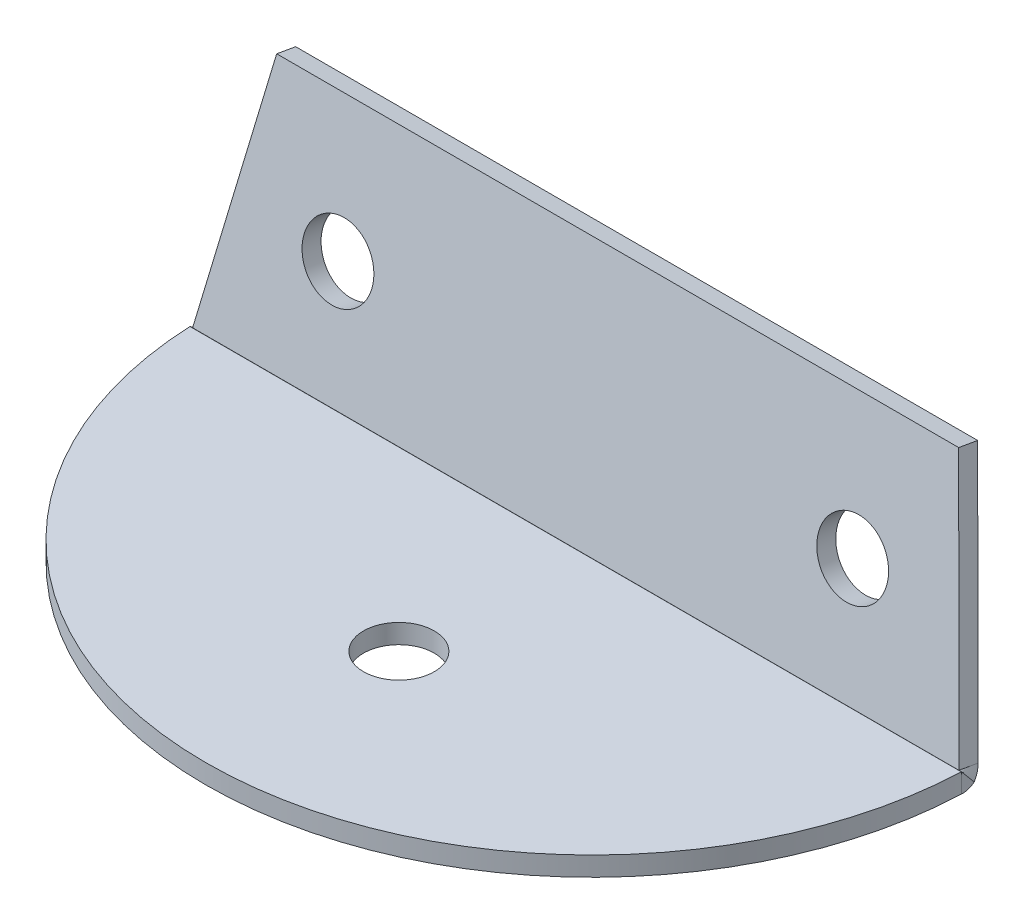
ISO-10303-21;
HEADER;
FILE_DESCRIPTION(('STEP AP214'),'2;1');
FILE_NAME('part.step','',(''),(''),'','','');
FILE_SCHEMA(('AUTOMOTIVE_DESIGN { 1 0 10303 214 1 1 1 1 }'));
ENDSEC;
DATA;
#1=APPLICATION_CONTEXT('core data for automotive mechanical design processes');
#2=APPLICATION_PROTOCOL_DEFINITION('international standard','automotive_design',2000,#1);
#3=PRODUCT_CONTEXT('',#1,'mechanical');
#4=PRODUCT('Part','Part','',(#3));
#5=PRODUCT_RELATED_PRODUCT_CATEGORY('part','',(#4));
#6=PRODUCT_DEFINITION_FORMATION('','',#4);
#7=PRODUCT_DEFINITION_CONTEXT('part definition',#1,'design');
#8=PRODUCT_DEFINITION('design','',#6,#7);
#9=PRODUCT_DEFINITION_SHAPE('','',#8);
#10=(LENGTH_UNIT() NAMED_UNIT(*) SI_UNIT(.MILLI.,.METRE.));
#11=(NAMED_UNIT(*) PLANE_ANGLE_UNIT() SI_UNIT($,.RADIAN.));
#12=(NAMED_UNIT(*) SI_UNIT($,.STERADIAN.) SOLID_ANGLE_UNIT());
#13=UNCERTAINTY_MEASURE_WITH_UNIT(LENGTH_MEASURE(1.E-05),#10,'distance_accuracy_value','');
#14=(GEOMETRIC_REPRESENTATION_CONTEXT(3) GLOBAL_UNCERTAINTY_ASSIGNED_CONTEXT((#13)) GLOBAL_UNIT_ASSIGNED_CONTEXT((#10,
#11,#12)) REPRESENTATION_CONTEXT('',''));
#15=CARTESIAN_POINT('',(0.,0.,0.));
#16=DIRECTION('',(0.,0.,1.));
#17=DIRECTION('',(1.,0.,0.));
#18=AXIS2_PLACEMENT_3D('',#15,#16,#17);
#19=CARTESIAN_POINT('',(3.5,19.9615513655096,-2.00162016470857));
#20=DIRECTION('',(0.985030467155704,-0.169761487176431,0.0299335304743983));
#21=DIRECTION('',(0.172380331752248,0.970065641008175,-0.17104874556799));
#22=AXIS2_PLACEMENT_3D('',#19,#20,#21);
#23=PLANE('',#22);
#24=DIRECTION('',(-0.172380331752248,-0.970065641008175,0.17104874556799));
#25=VECTOR('',#24,1.);
#26=CARTESIAN_POINT('',(3.5,19.7010790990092,-3.47883179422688));
#27=LINE('',#26,#25);
#28=CARTESIAN_POINT('',(3.5,19.7010790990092,-3.47883179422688));
#29=VERTEX_POINT('',#28);
#30=CARTESIAN_POINT('',(0.220857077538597,1.24779125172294,-0.225019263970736));
#31=VERTEX_POINT('',#30);
#32=EDGE_CURVE('E88',#29,#31,#27,.T.);
#33=ORIENTED_EDGE('',*,*,#32,.T.);
#34=CARTESIAN_POINT('',(0.220857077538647,1.50826351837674,1.25219236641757));
#35=CARTESIAN_POINT('',(0.220857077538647,1.24779125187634,-0.225019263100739));
#36=B_SPLINE_CURVE_WITH_KNOTS('',1,(#34,#35),.UNSPECIFIED.,.F.,.F.,(2,2),(0.,1.),.UNSPECIFIED.);
#37=CARTESIAN_POINT('',(0.220857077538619,1.50826351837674,1.25219236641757));
#38=VERTEX_POINT('',#37);
#39=EDGE_CURVE('E365',#31,#38,#36,.F.);
#40=ORIENTED_EDGE('',*,*,#39,.T.);
#41=DIRECTION('',(-0.172380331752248,-0.970065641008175,0.17104874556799));
#42=VECTOR('',#41,1.);
#43=CARTESIAN_POINT('',(3.5,19.9615513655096,-2.00162016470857));
#44=LINE('',#43,#42);
#45=CARTESIAN_POINT('',(3.5,19.9615513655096,-2.00162016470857));
#46=VERTEX_POINT('',#45);
#47=EDGE_CURVE('E431',#46,#38,#44,.T.);
#48=ORIENTED_EDGE('',*,*,#47,.F.);
#49=DIRECTION('',(0.,-0.173648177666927,-0.984807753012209));
#50=VECTOR('',#49,1.);
#51=CARTESIAN_POINT('',(3.5,19.9615513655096,-2.00162016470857));
#52=LINE('',#51,#50);
#53=EDGE_CURVE('E397',#46,#29,#52,.T.);
#54=ORIENTED_EDGE('',*,*,#53,.T.);
#55=EDGE_LOOP('',(#33,#40,#48,#54));
#56=FACE_BOUND('',#55,.T.);
#57=ADVANCED_FACE('F62',(#56),#23,.F.);
#58=CARTESIAN_POINT('',(56.5,19.9615513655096,-2.00162016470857));
#59=DIRECTION('',(-0.985030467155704,-0.169761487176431,0.0299335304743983));
#60=DIRECTION('',(0.172380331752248,-0.970065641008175,0.17104874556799));
#61=AXIS2_PLACEMENT_3D('',#58,#59,#60);
#62=PLANE('',#61);
#63=DIRECTION('',(-0.172380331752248,0.970065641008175,-0.17104874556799));
#64=VECTOR('',#63,1.);
#65=CARTESIAN_POINT('',(56.5,19.9615513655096,-2.00162016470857));
#66=LINE('',#65,#64);
#67=CARTESIAN_POINT('',(59.7791429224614,1.50826351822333,1.25219236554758));
#68=VERTEX_POINT('',#67);
#69=CARTESIAN_POINT('',(56.5,19.9615513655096,-2.00162016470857));
#70=VERTEX_POINT('',#69);
#71=EDGE_CURVE('E405',#68,#70,#66,.T.);
#72=ORIENTED_EDGE('',*,*,#71,.F.);
#73=CARTESIAN_POINT('',(59.7791429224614,1.24779125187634,-0.225019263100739));
#74=CARTESIAN_POINT('',(59.7791429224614,1.50826351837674,1.25219236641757));
#75=B_SPLINE_CURVE_WITH_KNOTS('',1,(#73,#74),.UNSPECIFIED.,.F.,.F.,(2,2),(0.,1.),.UNSPECIFIED.);
#76=CARTESIAN_POINT('',(59.7791429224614,1.24779125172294,-0.225019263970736));
#77=VERTEX_POINT('',#76);
#78=EDGE_CURVE('E12',#68,#77,#75,.F.);
#79=ORIENTED_EDGE('',*,*,#78,.T.);
#80=DIRECTION('',(-0.172380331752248,0.970065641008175,-0.17104874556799));
#81=VECTOR('',#80,1.);
#82=CARTESIAN_POINT('',(56.5,19.7010790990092,-3.47883179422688));
#83=LINE('',#82,#81);
#84=CARTESIAN_POINT('',(56.5,19.7010790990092,-3.47883179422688));
#85=VERTEX_POINT('',#84);
#86=EDGE_CURVE('E81',#77,#85,#83,.T.);
#87=ORIENTED_EDGE('',*,*,#86,.T.);
#88=DIRECTION('',(0.,-0.173648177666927,-0.984807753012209));
#89=VECTOR('',#88,1.);
#90=CARTESIAN_POINT('',(56.5,19.9615513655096,-2.00162016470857));
#91=LINE('',#90,#89);
#92=EDGE_CURVE('E394',#70,#85,#91,.T.);
#93=ORIENTED_EDGE('',*,*,#92,.F.);
#94=EDGE_LOOP('',(#72,#79,#87,#93));
#95=FACE_BOUND('',#94,.T.);
#96=ADVANCED_FACE('F64',(#95),#62,.F.);
#97=CARTESIAN_POINT('',(30.,0.00492403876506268,-0.00586824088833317));
#98=DIRECTION('',(0.,0.173648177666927,0.984807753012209));
#99=DIRECTION('',(0.,-0.984807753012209,0.173648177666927));
#100=AXIS2_PLACEMENT_3D('',#97,#98,#99);
#101=PLANE('',#100);
#102=CARTESIAN_POINT('',(10.,9.85300156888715,-1.74235001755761));
#103=DIRECTION('',(0.,0.173648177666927,0.984807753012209));
#104=DIRECTION('',(0.,-0.984807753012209,0.173648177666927));
#105=AXIS2_PLACEMENT_3D('',#102,#103,#104);
#106=CIRCLE('',#105,2.75);
#107=CARTESIAN_POINT('',(10.,7.14478024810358,-1.26481752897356));
#108=VERTEX_POINT('',#107);
#109=EDGE_CURVE('E442',#108,#108,#106,.T.);
#110=ORIENTED_EDGE('',*,*,#109,.T.);
#111=EDGE_LOOP('',(#110));
#112=FACE_BOUND('',#111,.T.);
#113=CARTESIAN_POINT('',(50.,9.85300156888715,-1.74235001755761));
#114=DIRECTION('',(0.,0.173648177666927,0.984807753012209));
#115=DIRECTION('',(0.,-0.984807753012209,0.173648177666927));
#116=AXIS2_PLACEMENT_3D('',#113,#114,#115);
#117=CIRCLE('',#116,2.75);
#118=CARTESIAN_POINT('',(50.,7.14478024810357,-1.26481752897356));
#119=VERTEX_POINT('',#118);
#120=EDGE_CURVE('E448',#119,#119,#117,.T.);
#121=ORIENTED_EDGE('',*,*,#120,.T.);
#122=EDGE_LOOP('',(#121));
#123=FACE_BOUND('',#122,.T.);
#124=ORIENTED_EDGE('',*,*,#86,.F.);
#125=DIRECTION('',(-1.,0.,0.));
#126=VECTOR('',#125,1.);
#127=CARTESIAN_POINT('',(30.,1.24779125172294,-0.225019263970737));
#128=LINE('',#127,#126);
#129=EDGE_CURVE('E74',#77,#31,#128,.T.);
#130=ORIENTED_EDGE('',*,*,#129,.T.);
#131=ORIENTED_EDGE('',*,*,#32,.F.);
#132=DIRECTION('',(-1.,0.,0.));
#133=VECTOR('',#132,1.);
#134=CARTESIAN_POINT('',(3.5,19.7010790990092,-3.47883179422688));
#135=LINE('',#134,#133);
#136=EDGE_CURVE('E424',#85,#29,#135,.T.);
#137=ORIENTED_EDGE('',*,*,#136,.F.);
#138=EDGE_LOOP('',(#124,#130,#131,#137));
#139=FACE_BOUND('',#138,.T.);
#140=ADVANCED_FACE('F561',(#112,#123,#139),#101,.F.);
#141=CARTESIAN_POINT('',(30.,0.265396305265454,1.47134338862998));
#142=DIRECTION('',(0.,0.173648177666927,0.984807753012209));
#143=DIRECTION('',(0.,-0.984807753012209,0.173648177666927));
#144=AXIS2_PLACEMENT_3D('',#141,#142,#143);
#145=PLANE('',#144);
#146=DIRECTION('',(-1.,0.,0.));
#147=VECTOR('',#146,1.);
#148=CARTESIAN_POINT('',(30.,1.50826351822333,1.25219236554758));
#149=LINE('',#148,#147);
#150=EDGE_CURVE('E383',#68,#38,#149,.T.);
#151=ORIENTED_EDGE('',*,*,#150,.F.);
#152=ORIENTED_EDGE('',*,*,#71,.T.);
#153=DIRECTION('',(-1.,0.,0.));
#154=VECTOR('',#153,1.);
#155=CARTESIAN_POINT('',(3.5,19.9615513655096,-2.00162016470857));
#156=LINE('',#155,#154);
#157=EDGE_CURVE('E407',#70,#46,#156,.T.);
#158=ORIENTED_EDGE('',*,*,#157,.T.);
#159=ORIENTED_EDGE('',*,*,#47,.T.);
#160=EDGE_LOOP('',(#151,#152,#158,#159));
#161=FACE_BOUND('',#160,.T.);
#162=CARTESIAN_POINT('',(50.,10.1134738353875,-0.265138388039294));
#163=DIRECTION('',(0.,0.173648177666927,0.984807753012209));
#164=DIRECTION('',(0.,-0.984807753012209,0.173648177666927));
#165=AXIS2_PLACEMENT_3D('',#162,#163,#164);
#166=CIRCLE('',#165,2.75);
#167=CARTESIAN_POINT('',(50.,7.40525251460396,0.212394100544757));
#168=VERTEX_POINT('',#167);
#169=EDGE_CURVE('E445',#168,#168,#166,.T.);
#170=ORIENTED_EDGE('',*,*,#169,.F.);
#171=EDGE_LOOP('',(#170));
#172=FACE_BOUND('',#171,.T.);
#173=CARTESIAN_POINT('',(10.,10.1134738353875,-0.265138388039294));
#174=DIRECTION('',(0.,0.173648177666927,0.984807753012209));
#175=DIRECTION('',(0.,-0.984807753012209,0.173648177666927));
#176=AXIS2_PLACEMENT_3D('',#173,#174,#175);
#177=CIRCLE('',#176,2.75);
#178=CARTESIAN_POINT('',(10.,7.40525251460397,0.212394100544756));
#179=VERTEX_POINT('',#178);
#180=EDGE_CURVE('E425',#179,#179,#177,.T.);
#181=ORIENTED_EDGE('',*,*,#180,.F.);
#182=EDGE_LOOP('',(#181));
#183=FACE_BOUND('',#182,.T.);
#184=ADVANCED_FACE('F432',(#161,#172,#183),#145,.T.);
#185=CARTESIAN_POINT('',(3.5,19.9615513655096,-2.00162016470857));
#186=DIRECTION('',(0.,-0.984807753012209,0.173648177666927));
#187=DIRECTION('',(1.,0.,0.));
#188=AXIS2_PLACEMENT_3D('',#185,#186,#187);
#189=PLANE('',#188);
#190=ORIENTED_EDGE('',*,*,#136,.T.);
#191=ORIENTED_EDGE('',*,*,#53,.F.);
#192=ORIENTED_EDGE('',*,*,#157,.F.);
#193=ORIENTED_EDGE('',*,*,#92,.T.);
#194=EDGE_LOOP('',(#190,#191,#192,#193));
#195=FACE_BOUND('',#194,.T.);
#196=ADVANCED_FACE('F570',(#195),#189,.F.);
#197=CARTESIAN_POINT('',(10.,10.1134738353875,-0.265138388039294));
#198=DIRECTION('',(0.,-0.173648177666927,-0.984807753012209));
#199=DIRECTION('',(0.,0.984807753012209,-0.173648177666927));
#200=AXIS2_PLACEMENT_3D('',#197,#198,#199);
#201=CYLINDRICAL_SURFACE('',#200,2.75);
#202=ORIENTED_EDGE('',*,*,#180,.T.);
#203=EDGE_LOOP('',(#202));
#204=FACE_BOUND('',#203,.T.);
#205=ORIENTED_EDGE('',*,*,#109,.F.);
#206=EDGE_LOOP('',(#205));
#207=FACE_BOUND('',#206,.T.);
#208=ADVANCED_FACE('F555',(#204,#207),#201,.F.);
#209=CARTESIAN_POINT('',(50.,10.1134738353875,-0.265138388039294));
#210=DIRECTION('',(0.,-0.173648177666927,-0.984807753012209));
#211=DIRECTION('',(0.,0.984807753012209,-0.173648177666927));
#212=AXIS2_PLACEMENT_3D('',#209,#210,#211);
#213=CYLINDRICAL_SURFACE('',#212,2.75);
#214=ORIENTED_EDGE('',*,*,#169,.T.);
#215=EDGE_LOOP('',(#214));
#216=FACE_BOUND('',#215,.T.);
#217=ORIENTED_EDGE('',*,*,#120,.F.);
#218=EDGE_LOOP('',(#217));
#219=FACE_BOUND('',#218,.T.);
#220=ADVANCED_FACE('F551',(#216,#219),#213,.F.);
#221=CARTESIAN_POINT('',(30.,1.5,15.));
#222=DIRECTION('',(0.,-1.,0.));
#223=DIRECTION('',(0.,0.,-1.));
#224=AXIS2_PLACEMENT_3D('',#221,#222,#223);
#225=CYLINDRICAL_SURFACE('',#224,2.75);
#226=CARTESIAN_POINT('',(30.,1.5,15.));
#227=DIRECTION('',(0.,1.,0.));
#228=DIRECTION('',(0.,0.,1.));
#229=AXIS2_PLACEMENT_3D('',#226,#227,#228);
#230=CIRCLE('',#229,2.75);
#231=CARTESIAN_POINT('',(30.,1.5,17.75));
#232=VERTEX_POINT('',#231);
#233=EDGE_CURVE('E496',#232,#232,#230,.T.);
#234=ORIENTED_EDGE('',*,*,#233,.T.);
#235=EDGE_LOOP('',(#234));
#236=FACE_BOUND('',#235,.T.);
#237=CARTESIAN_POINT('',(30.,0.,15.));
#238=DIRECTION('',(0.,1.,0.));
#239=DIRECTION('',(0.,0.,1.));
#240=AXIS2_PLACEMENT_3D('',#237,#238,#239);
#241=CIRCLE('',#240,2.75);
#242=CARTESIAN_POINT('',(30.,0.,17.75));
#243=VERTEX_POINT('',#242);
#244=EDGE_CURVE('E451',#243,#243,#241,.T.);
#245=ORIENTED_EDGE('',*,*,#244,.F.);
#246=EDGE_LOOP('',(#245));
#247=FACE_BOUND('',#246,.T.);
#248=ADVANCED_FACE('F542',(#236,#247),#225,.F.);
#249=CARTESIAN_POINT('',(30.,1.5,0.));
#250=DIRECTION('',(0.,1.,0.));
#251=DIRECTION('',(0.,0.,1.));
#252=AXIS2_PLACEMENT_3D('',#249,#250,#251);
#253=PLANE('',#252);
#254=ORIENTED_EDGE('',*,*,#233,.F.);
#255=EDGE_LOOP('',(#254));
#256=FACE_BOUND('',#255,.T.);
#257=CARTESIAN_POINT('',(30.,1.5,0.));
#258=DIRECTION('',(0.,1.,0.));
#259=DIRECTION('',(0.,0.,1.));
#260=AXIS2_PLACEMENT_3D('',#257,#258,#259);
#261=CIRCLE('',#260,30.);
#262=CARTESIAN_POINT('',(0.0265575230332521,1.50000000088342,1.2620404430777));
#263=VERTEX_POINT('',#262);
#264=CARTESIAN_POINT('',(59.9734424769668,1.5,1.2620404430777));
#265=VERTEX_POINT('',#264);
#266=EDGE_CURVE('E493',#263,#265,#261,.T.);
#267=ORIENTED_EDGE('',*,*,#266,.T.);
#268=DIRECTION('',(-1.,0.,0.));
#269=VECTOR('',#268,1.);
#270=CARTESIAN_POINT('',(30.,1.5,1.2620404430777));
#271=LINE('',#270,#269);
#272=EDGE_CURVE('E487',#265,#263,#271,.T.);
#273=ORIENTED_EDGE('',*,*,#272,.T.);
#274=EDGE_LOOP('',(#267,#273));
#275=FACE_BOUND('',#274,.T.);
#276=ADVANCED_FACE('F467',(#256,#275),#253,.T.);
#277=CARTESIAN_POINT('',(30.,1.5,0.));
#278=DIRECTION('',(0.,-1.,0.));
#279=DIRECTION('',(0.,0.,-1.));
#280=AXIS2_PLACEMENT_3D('',#277,#278,#279);
#281=CYLINDRICAL_SURFACE('',#280,30.);
#282=CARTESIAN_POINT('',(59.9734424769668,1.50000000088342,1.2620404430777));
#283=CARTESIAN_POINT('',(59.9734424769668,8.83419422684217E-10,1.2620404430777));
#284=B_SPLINE_CURVE_WITH_KNOTS('',1,(#282,#283),.UNSPECIFIED.,.F.,.F.,(2,2),(0.,1.),.UNSPECIFIED.);
#285=CARTESIAN_POINT('',(59.9734424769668,0.,1.2620404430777));
#286=VERTEX_POINT('',#285);
#287=EDGE_CURVE('E146',#265,#286,#284,.T.);
#288=ORIENTED_EDGE('',*,*,#287,.F.);
#289=ORIENTED_EDGE('',*,*,#266,.F.);
#290=CARTESIAN_POINT('',(0.0265575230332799,8.83419422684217E-10,1.2620404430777));
#291=CARTESIAN_POINT('',(0.0265575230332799,1.50000000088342,1.2620404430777));
#292=B_SPLINE_CURVE_WITH_KNOTS('',1,(#290,#291),.UNSPECIFIED.,.F.,.F.,(2,2),(0.,1.),.UNSPECIFIED.);
#293=CARTESIAN_POINT('',(0.0265575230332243,0.,1.2620404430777));
#294=VERTEX_POINT('',#293);
#295=EDGE_CURVE('E358',#294,#263,#292,.T.);
#296=ORIENTED_EDGE('',*,*,#295,.F.);
#297=CARTESIAN_POINT('',(30.,0.,0.));
#298=DIRECTION('',(0.,1.,0.));
#299=DIRECTION('',(0.,0.,1.));
#300=AXIS2_PLACEMENT_3D('',#297,#298,#299);
#301=CIRCLE('',#300,30.);
#302=EDGE_CURVE('E486',#294,#286,#301,.T.);
#303=ORIENTED_EDGE('',*,*,#302,.T.);
#304=EDGE_LOOP('',(#288,#289,#296,#303));
#305=FACE_BOUND('',#304,.T.);
#306=ADVANCED_FACE('F457',(#305),#281,.T.);
#307=CARTESIAN_POINT('',(30.,0.,0.));
#308=DIRECTION('',(0.,1.,0.));
#309=DIRECTION('',(0.,0.,1.));
#310=AXIS2_PLACEMENT_3D('',#307,#308,#309);
#311=PLANE('',#310);
#312=DIRECTION('',(-1.,0.,0.));
#313=VECTOR('',#312,1.);
#314=CARTESIAN_POINT('',(30.,0.,1.2620404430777));
#315=LINE('',#314,#313);
#316=EDGE_CURVE('E477',#286,#294,#315,.T.);
#317=ORIENTED_EDGE('',*,*,#316,.F.);
#318=ORIENTED_EDGE('',*,*,#302,.F.);
#319=EDGE_LOOP('',(#317,#318));
#320=FACE_BOUND('',#319,.T.);
#321=ORIENTED_EDGE('',*,*,#244,.T.);
#322=EDGE_LOOP('',(#321));
#323=FACE_BOUND('',#322,.T.);
#324=ADVANCED_FACE('F190',(#320,#323),#311,.F.);
#325=CARTESIAN_POINT('',(59.9734424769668,8.83419422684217E-10,1.2620404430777));
#326=CARTESIAN_POINT('',(59.9789715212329,8.83419422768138E-10,1.19305723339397));
#327=CARTESIAN_POINT('',(59.984031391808,0.00223056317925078,1.06813176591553));
#328=CARTESIAN_POINT('',(59.9928838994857,0.0870330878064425,0.727125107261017));
#329=CARTESIAN_POINT('',(59.9967098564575,0.170992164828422,0.508664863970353));
#330=CARTESIAN_POINT('',(60.,0.353272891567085,0.29143115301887));
#331=CARTESIAN_POINT('',(59.9734424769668,1.50000000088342,1.2620404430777));
#332=CARTESIAN_POINT('',(59.9790259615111,1.50000000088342,1.2615791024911));
#333=CARTESIAN_POINT('',(59.984031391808,1.50001477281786,1.26075627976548));
#334=CARTESIAN_POINT('',(59.9928838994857,1.50057637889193,1.25849795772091));
#335=CARTESIAN_POINT('',(59.9967260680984,1.50113834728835,1.25704411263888));
#336=CARTESIAN_POINT('',(60.,1.50233955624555,1.25561256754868));
#337=B_SPLINE_SURFACE_WITH_KNOTS('',1,3,((#325,#326,#327,#328,#329,#330),(#331,#332,#333,#334,
#335,#336)),.UNSPECIFIED.,.F.,.F.,.F.,(2,2),(4,2,4),(0.,1.),(0.,0.5,1.),.UNSPECIFIED.);
#338=CARTESIAN_POINT('',(59.9734424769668,8.83419422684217E-10,1.2620404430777));
#339=CARTESIAN_POINT('',(59.9789715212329,8.83419422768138E-10,1.19305723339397));
#340=CARTESIAN_POINT('',(59.984031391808,0.00223056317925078,1.06813176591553));
#341=CARTESIAN_POINT('',(59.9928838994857,0.0870330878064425,0.727125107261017));
#342=CARTESIAN_POINT('',(59.9967098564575,0.170992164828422,0.508664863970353));
#343=CARTESIAN_POINT('',(60.,0.353272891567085,0.29143115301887));
#344=B_SPLINE_CURVE_WITH_KNOTS('',3,(#338,#339,#340,#341,#342,#343),.UNSPECIFIED.,.F.,.F.,(4,2,
4),(0.,0.5,1.),.UNSPECIFIED.);
#345=CARTESIAN_POINT('',(59.9999999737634,0.353271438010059,0.291432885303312));
#346=VERTEX_POINT('',#345);
#347=EDGE_CURVE('E157',#286,#346,#344,.T.);
#348=CARTESIAN_POINT('',(60.,0.353272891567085,0.29143115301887));
#349=CARTESIAN_POINT('',(60.,1.50233955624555,1.25561256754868));
#350=B_SPLINE_CURVE_WITH_KNOTS('',1,(#348,#349),.UNSPECIFIED.,.F.,.F.,(2,2),(0.,1.),.UNSPECIFIED.);
#351=CARTESIAN_POINT('',(60.,1.50233955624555,1.25561256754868));
#352=VERTEX_POINT('',#351);
#353=EDGE_CURVE('E131',#346,#352,#350,.T.);
#354=CARTESIAN_POINT('',(60.,1.50233955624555,1.25561256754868));
#355=CARTESIAN_POINT('',(59.9967260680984,1.50113834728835,1.25704411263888));
#356=CARTESIAN_POINT('',(59.9928838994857,1.50057637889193,1.25849795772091));
#357=CARTESIAN_POINT('',(59.984031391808,1.50001477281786,1.26075627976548));
#358=CARTESIAN_POINT('',(59.9790259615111,1.50000000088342,1.2615791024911));
#359=CARTESIAN_POINT('',(59.9734424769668,1.50000000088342,1.2620404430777));
#360=B_SPLINE_CURVE_WITH_KNOTS('',3,(#354,#355,#356,#357,#358,#359),.UNSPECIFIED.,.F.,.F.,(4,2,
4),(0.,0.5,1.),.UNSPECIFIED.);
#361=EDGE_CURVE('E290',#265,#352,#360,.F.);
#362=ORIENTED_EDGE('',*,*,#287,.T.);
#363=ORIENTED_EDGE('',*,*,#347,.T.);
#364=ORIENTED_EDGE('',*,*,#353,.T.);
#365=ORIENTED_EDGE('',*,*,#361,.F.);
#366=EDGE_LOOP('',(#362,#363,#364,#365));
#367=FACE_BOUND('',#366,.T.);
#368=ADVANCED_FACE('F164',(#367),#337,.F.);
#369=CARTESIAN_POINT('',(60.,0.353272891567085,0.29143115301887));
#370=CARTESIAN_POINT('',(59.926082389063,0.580060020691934,0.0211567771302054));
#371=CARTESIAN_POINT('',(59.8530605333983,0.900333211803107,-0.163753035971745));
#372=CARTESIAN_POINT('',(59.7791429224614,1.24779125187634,-0.225019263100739));
#373=CARTESIAN_POINT('',(60.,1.50233955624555,1.25561256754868));
#374=CARTESIAN_POINT('',(59.9263804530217,1.50383540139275,1.25382988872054));
#375=CARTESIAN_POINT('',(59.8527624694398,1.50597175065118,1.25259646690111));
#376=CARTESIAN_POINT('',(59.7791429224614,1.50826351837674,1.25219236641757));
#377=B_SPLINE_SURFACE_WITH_KNOTS('',1,3,((#369,#370,#371,#372),(#373,#374,#375,#376)),
.UNSPECIFIED.,.F.,.F.,.F.,(2,2),(4,4),(0.,1.),(0.,1.),.UNSPECIFIED.);
#378=CARTESIAN_POINT('',(60.,0.353272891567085,0.29143115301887));
#379=CARTESIAN_POINT('',(59.926082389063,0.580060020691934,0.0211567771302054));
#380=CARTESIAN_POINT('',(59.8530605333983,0.900333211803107,-0.163753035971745));
#381=CARTESIAN_POINT('',(59.7791429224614,1.24779125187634,-0.225019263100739));
#382=B_SPLINE_CURVE_WITH_KNOTS('',3,(#378,#379,#380,#381),.UNSPECIFIED.,.F.,.F.,(4,4),(0.,1.),.UNSPECIFIED.);
#383=EDGE_CURVE('E136',#346,#77,#382,.T.);
#384=CARTESIAN_POINT('',(59.7791429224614,1.50826351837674,1.25219236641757));
#385=CARTESIAN_POINT('',(59.8527624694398,1.50597175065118,1.25259646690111));
#386=CARTESIAN_POINT('',(59.9263804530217,1.50383540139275,1.25382988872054));
#387=CARTESIAN_POINT('',(60.,1.50233955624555,1.25561256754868));
#388=B_SPLINE_CURVE_WITH_KNOTS('',3,(#384,#385,#386,#387),.UNSPECIFIED.,.F.,.F.,(4,4),(0.,1.),.UNSPECIFIED.);
#389=EDGE_CURVE('E139',#352,#68,#388,.F.);
#390=ORIENTED_EDGE('',*,*,#353,.F.);
#391=ORIENTED_EDGE('',*,*,#383,.T.);
#392=ORIENTED_EDGE('',*,*,#78,.F.);
#393=ORIENTED_EDGE('',*,*,#389,.F.);
#394=EDGE_LOOP('',(#390,#391,#392,#393));
#395=FACE_BOUND('',#394,.T.);
#396=ADVANCED_FACE('F134',(#395),#377,.F.);
#397=CARTESIAN_POINT('',(0.220857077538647,1.24779125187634,-0.225019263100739));
#398=CARTESIAN_POINT('',(0.146939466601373,0.900333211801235,-0.163753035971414));
#399=CARTESIAN_POINT('',(0.0739176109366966,0.580060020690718,0.0211567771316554));
#400=CARTESIAN_POINT('',(0.,0.353272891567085,0.29143115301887));
#401=CARTESIAN_POINT('',(0.220857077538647,1.50826351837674,1.25219236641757));
#402=CARTESIAN_POINT('',(0.14723753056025,1.50597175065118,1.25259646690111));
#403=CARTESIAN_POINT('',(0.0736195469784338,1.50383540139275,1.25382988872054));
#404=CARTESIAN_POINT('',(0.,1.50233955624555,1.25561256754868));
#405=B_SPLINE_SURFACE_WITH_KNOTS('',1,3,((#397,#398,#399,#400),(#401,#402,#403,#404)),
.UNSPECIFIED.,.F.,.F.,.F.,(2,2),(4,4),(0.,1.),(0.,1.),.UNSPECIFIED.);
#406=CARTESIAN_POINT('',(0.220857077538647,1.24779125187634,-0.225019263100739));
#407=CARTESIAN_POINT('',(0.146939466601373,0.900333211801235,-0.163753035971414));
#408=CARTESIAN_POINT('',(0.0739176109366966,0.580060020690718,0.0211567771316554));
#409=CARTESIAN_POINT('',(0.,0.353272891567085,0.29143115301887));
#410=B_SPLINE_CURVE_WITH_KNOTS('',3,(#406,#407,#408,#409),.UNSPECIFIED.,.F.,.F.,(4,4),(0.,1.),.UNSPECIFIED.);
#411=CARTESIAN_POINT('',(4.73763459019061E-07,0.353274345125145,0.291429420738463));
#412=VERTEX_POINT('',#411);
#413=EDGE_CURVE('E159',#31,#412,#410,.T.);
#414=CARTESIAN_POINT('',(0.,0.353272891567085,0.29143115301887));
#415=CARTESIAN_POINT('',(0.,1.50233955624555,1.25561256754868));
#416=B_SPLINE_CURVE_WITH_KNOTS('',1,(#414,#415),.UNSPECIFIED.,.F.,.F.,(2,2),(0.,1.),.UNSPECIFIED.);
#417=CARTESIAN_POINT('',(0.,1.50233955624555,1.25561256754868));
#418=VERTEX_POINT('',#417);
#419=EDGE_CURVE('E147',#412,#418,#416,.T.);
#420=CARTESIAN_POINT('',(0.,1.50233955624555,1.25561256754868));
#421=CARTESIAN_POINT('',(0.0736195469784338,1.50383540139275,1.25382988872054));
#422=CARTESIAN_POINT('',(0.14723753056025,1.50597175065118,1.25259646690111));
#423=CARTESIAN_POINT('',(0.220857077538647,1.50826351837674,1.25219236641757));
#424=B_SPLINE_CURVE_WITH_KNOTS('',3,(#420,#421,#422,#423),.UNSPECIFIED.,.F.,.F.,(4,4),(0.,1.),.UNSPECIFIED.);
#425=EDGE_CURVE('E375',#38,#418,#424,.F.);
#426=ORIENTED_EDGE('',*,*,#39,.F.);
#427=ORIENTED_EDGE('',*,*,#413,.T.);
#428=ORIENTED_EDGE('',*,*,#419,.T.);
#429=ORIENTED_EDGE('',*,*,#425,.F.);
#430=EDGE_LOOP('',(#426,#427,#428,#429));
#431=FACE_BOUND('',#430,.T.);
#432=ADVANCED_FACE('F231',(#431),#405,.F.);
#433=CARTESIAN_POINT('',(0.,0.353272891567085,0.29143115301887));
#434=CARTESIAN_POINT('',(0.00329014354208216,0.170992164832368,0.508664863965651));
#435=CARTESIAN_POINT('',(0.00711610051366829,0.0870330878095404,0.727125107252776));
#436=CARTESIAN_POINT('',(0.0159686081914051,0.00223056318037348,1.06813176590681));
#437=CARTESIAN_POINT('',(0.0210284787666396,8.83419422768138E-10,1.19305723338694));
#438=CARTESIAN_POINT('',(0.0265575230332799,8.83419422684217E-10,1.2620404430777));
#439=CARTESIAN_POINT('',(0.,1.50233955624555,1.25561256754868));
#440=CARTESIAN_POINT('',(0.00327393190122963,1.50113834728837,1.25704411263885));
#441=CARTESIAN_POINT('',(0.00711610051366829,1.50057637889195,1.25849795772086));
#442=CARTESIAN_POINT('',(0.0159686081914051,1.50001477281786,1.26075627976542));
#443=CARTESIAN_POINT('',(0.0209740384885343,1.50000000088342,1.26157910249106));
#444=CARTESIAN_POINT('',(0.0265575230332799,1.50000000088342,1.2620404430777));
#445=B_SPLINE_SURFACE_WITH_KNOTS('',1,3,((#433,#434,#435,#436,#437,#438),(#439,#440,#441,#442,
#443,#444)),.UNSPECIFIED.,.F.,.F.,.F.,(2,2),(4,2,4),(0.,1.),(0.,0.5,1.),.UNSPECIFIED.);
#446=CARTESIAN_POINT('',(0.,0.353272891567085,0.29143115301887));
#447=CARTESIAN_POINT('',(0.00329014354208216,0.170992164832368,0.508664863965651));
#448=CARTESIAN_POINT('',(0.00711610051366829,0.0870330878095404,0.727125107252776));
#449=CARTESIAN_POINT('',(0.0159686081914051,0.00223056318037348,1.06813176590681));
#450=CARTESIAN_POINT('',(0.0210284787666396,8.83419422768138E-10,1.19305723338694));
#451=CARTESIAN_POINT('',(0.0265575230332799,8.83419422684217E-10,1.2620404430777));
#452=B_SPLINE_CURVE_WITH_KNOTS('',3,(#446,#447,#448,#449,#450,#451),.UNSPECIFIED.,.F.,.F.,(4,2,
4),(0.,0.5,1.),.UNSPECIFIED.);
#453=EDGE_CURVE('E349',#412,#294,#452,.T.);
#454=CARTESIAN_POINT('',(0.0265575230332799,1.50000000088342,1.2620404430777));
#455=CARTESIAN_POINT('',(0.0209740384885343,1.50000000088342,1.26157910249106));
#456=CARTESIAN_POINT('',(0.0159686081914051,1.50001477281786,1.26075627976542));
#457=CARTESIAN_POINT('',(0.00711610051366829,1.50057637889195,1.25849795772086));
#458=CARTESIAN_POINT('',(0.00327393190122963,1.50113834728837,1.25704411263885));
#459=CARTESIAN_POINT('',(0.,1.50233955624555,1.25561256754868));
#460=B_SPLINE_CURVE_WITH_KNOTS('',3,(#454,#455,#456,#457,#458,#459),.UNSPECIFIED.,.F.,.F.,(4,2,
4),(0.,0.5,1.),.UNSPECIFIED.);
#461=EDGE_CURVE('E339',#418,#263,#460,.F.);
#462=ORIENTED_EDGE('',*,*,#453,.T.);
#463=ORIENTED_EDGE('',*,*,#295,.T.);
#464=ORIENTED_EDGE('',*,*,#461,.F.);
#465=ORIENTED_EDGE('',*,*,#419,.F.);
#466=EDGE_LOOP('',(#462,#463,#464,#465));
#467=FACE_BOUND('',#466,.T.);
#468=ADVANCED_FACE('F195',(#467),#445,.F.);
#469=CARTESIAN_POINT('',(90.0717985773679,1.51,1.2620404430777));
#470=DIRECTION('',(-1.,0.,0.));
#471=DIRECTION('',(0.,0.,1.));
#472=AXIS2_PLACEMENT_3D('',#469,#470,#471);
#473=CYLINDRICAL_SURFACE('',#472,0.00999999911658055);
#474=ORIENTED_EDGE('',*,*,#425,.T.);
#475=ORIENTED_EDGE('',*,*,#461,.T.);
#476=ORIENTED_EDGE('',*,*,#272,.F.);
#477=ORIENTED_EDGE('',*,*,#361,.T.);
#478=ORIENTED_EDGE('',*,*,#389,.T.);
#479=ORIENTED_EDGE('',*,*,#150,.T.);
#480=EDGE_LOOP('',(#474,#475,#476,#477,#478,#479));
#481=FACE_BOUND('',#480,.T.);
#482=ADVANCED_FACE('F243',(#481),#473,.F.);
#483=CARTESIAN_POINT('',(90.0717985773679,1.51,1.2620404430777));
#484=DIRECTION('',(-1.,0.,0.));
#485=DIRECTION('',(0.,0.,1.));
#486=AXIS2_PLACEMENT_3D('',#483,#484,#485);
#487=CYLINDRICAL_SURFACE('',#486,1.50999999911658);
#488=ORIENTED_EDGE('',*,*,#413,.F.);
#489=ORIENTED_EDGE('',*,*,#129,.F.);
#490=ORIENTED_EDGE('',*,*,#383,.F.);
#491=ORIENTED_EDGE('',*,*,#347,.F.);
#492=ORIENTED_EDGE('',*,*,#316,.T.);
#493=ORIENTED_EDGE('',*,*,#453,.F.);
#494=EDGE_LOOP('',(#488,#489,#490,#491,#492,#493));
#495=FACE_BOUND('',#494,.T.);
#496=ADVANCED_FACE('F155',(#495),#487,.T.);
#497=CLOSED_SHELL('',(#57,#96,#140,#184,#196,#208,#220,#248,#276,#306,#324,#368,#396,#432,#468,
#482,#496));
#498=MANIFOLD_SOLID_BREP('B2',#497);
#499=ADVANCED_BREP_SHAPE_REPRESENTATION('',(#18,#498),#14);
#500=SHAPE_DEFINITION_REPRESENTATION(#9,#499);
ENDSEC;
END-ISO-10303-21;
